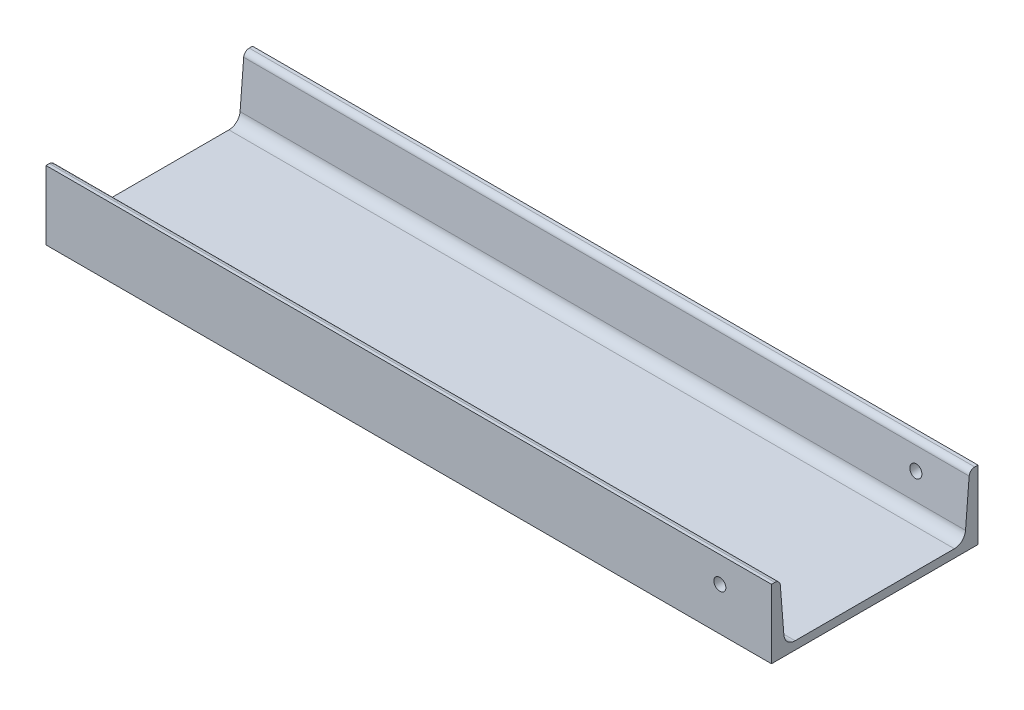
from build123d import *

# Parameters (mm, degrees)
BASE_EXTRUSION_DEPTH    = 843
ESQUISSE2_R             = 7
ENL_V_MAT_EXTRU_1_DEPTH = 881.141465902


with BuildPart() as part:
    # Esquisse1 → Base-Extrusion (new body)
    with BuildSketch(Plane(origin=(0, 0, 0), x_dir=(0, 0, -1), z_dir=(1, 0, 0))):
        with BuildLine():
            Line((-120, 0), (120, 0))
            Line((120, 0), (120, 80))
            Line((120, 80), (116.198423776, 80))
            ThreePointArc((116.198423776, 80), (111.789135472, 78.275790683), (109.719089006, 74.017900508))
            Line((109.719089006, 74.017900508), (105.5184126, 21.464198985))
            ThreePointArc((105.5184126, 21.464198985), (101.378319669, 12.948418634), (92.55974306, 9.5))
            Line((92.55974306, 9.5), (-92.55974306, 9.5))
            ThreePointArc((-92.55974306, 9.5), (-101.378319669, 12.948418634), (-105.5184126, 21.464198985))
            Line((-105.5184126, 21.464198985), (-109.719089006, 74.017900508))
            ThreePointArc((-109.719089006, 74.017900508), (-111.789135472, 78.275790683), (-116.198423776, 80))
            Line((-116.198423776, 80), (-120, 80))
            Line((-120, 80), (-120, 0))
        make_face()
    extrude(amount=BASE_EXTRUSION_DEPTH)

    # Esquisse2 → Enl_v. mat.-Extru.1 (cut, through all)
    with BuildSketch(Plane.XY.offset(120)):
        with Locations((783, 50)):
            Circle(ESQUISSE2_R)
    extrude(amount=-ENL_V_MAT_EXTRU_1_DEPTH, mode=Mode.SUBTRACT)


solid = part.part
